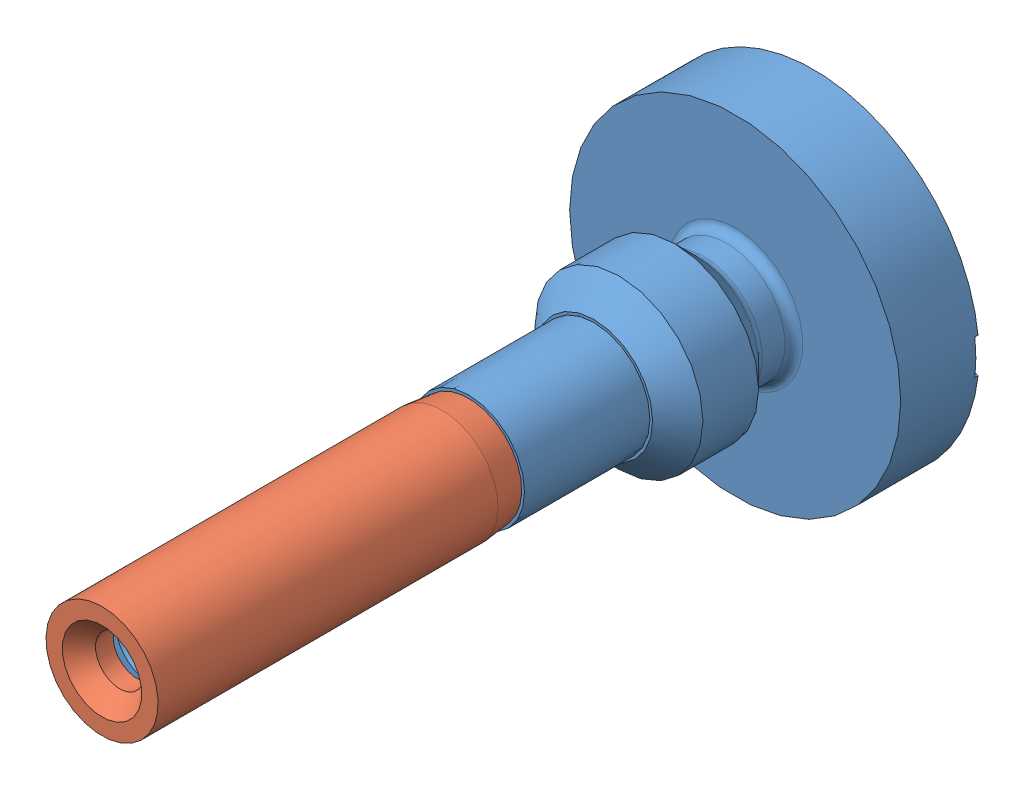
SolidWorks assembly F180914000.SLDASM, configuration Default (file format 3100). Lengths in mm.
Overall size (9.53 9.53 21.31).
2 component instances, 2 part files, 2 mates.
Components (placement in the parent):
- F180914000-1: F180914000.SLDPRT [Default] at origin size (9.53 9.53 19.92)
- F180914000_02-1: F180914000_02.SLDPRT [Default] at (0 0 7.6708) x (-0.923728 -0.383049 0) z (0 0 -1) size (3.23 3.23 10.54)
Mates (geometry in assembly coordinates):
- Coincident1: coincident: plane of F180914000-1; plane of F180914000_02-1
- Concentric1: concentric aligned: cylinder of F180914000-1; cylinder of F180914000_02-1
